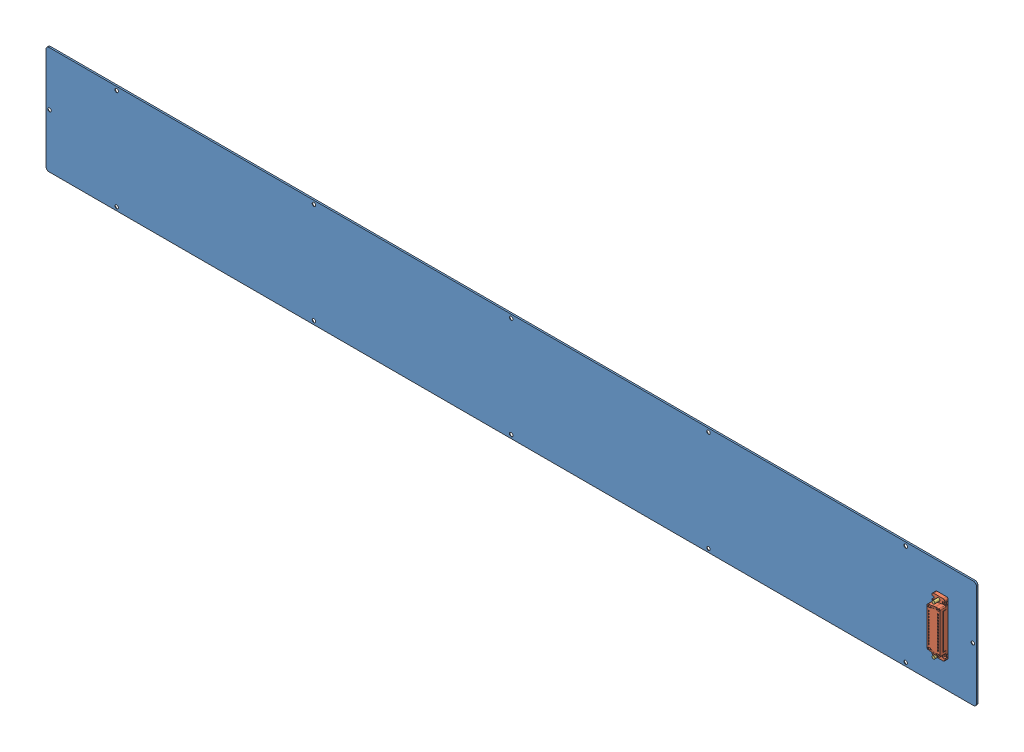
SolidWorks assembly Assy, Back Cover, X-Axis, 685mm Travel, ProdA, PP00.SLDASM, configuration Default (file format 8000). Lengths in mm.
Overall size (915 106 14.8).
4 component instances, 3 part files, 7 mates.
Components (placement in the parent):
- Cover, Back, X-Axis, 685mm Travel, ProdA, PP00-1: Cover, Back, X-Axis, 685mm Travel, ProdA, PP00.SLDPRT [Default] at origin size (915 106 1.57)
- Amp Dsub 25 Pin Recept IDC 1658610-2-1: Amp Dsub 25 Pin Recept IDC 1658610-2.SLDPRT [Default] at (423.5 -0.0204 -4.572) x (0 1 0) z (0 0 -1) size (53.09 12.6 14.38)
- Dsub_mtng_standoff-1: Dsub_mtng_standoff.sldprt [Default] at (423.5 -23.5 -5) x (1 0 0) z (0 -1 0) size (5.48 14.8 4.83)
- Dsub_mtng_standoff-2: Dsub_mtng_standoff.sldprt [Default] at (423.5 23.5 -5) x (1 0 0) z (0 -1 0) size (5.48 14.8 4.83)
Mates (geometry in assembly coordinates):
- Coincident304: coincident anti-aligned: plane of Cover, Back, X-Axis, 685mm Travel, ProdA, PP00-1 through (0 0 0) normal (0 0 -1); plane of Dsub_mtng_standoff-1 through (422.0569 -25.832 0) normal (0 0 1)
- Coincident305: coincident anti-aligned: plane of Cover, Back, X-Axis, 685mm Travel, ProdA, PP00-1 through (0 0 0) normal (0 0 -1); plane of Dsub_mtng_standoff-2 through (422.0569 21.168 0) normal (0 0 1)
- Concentric102: concentric anti-aligned: circle of Cover, Back, X-Axis, 685mm Travel, ProdA, PP00-1; cylinder of Amp Dsub 25 Pin Recept IDC 1658610-2-1 through (423.5 23.5 1.5748) axis (0 0 1) radius 1.524
- Parallel2: parallel anti-aligned: plane of Cover, Back, X-Axis, 685mm Travel, ProdA, PP00-1 through (-457.5 -53 1.5748) normal (-1 0 0); plane of Amp Dsub 25 Pin Recept IDC 1658610-2-1 through (429.7992 -24.9886 1.5748) normal (1 0 0)
- Coincident307: coincident anti-aligned: plane of Cover, Back, X-Axis, 685mm Travel, ProdA, PP00-1 through (0 0 1.5748) normal (0 0 1); plane of Amp Dsub 25 Pin Recept IDC 1658610-2-1 through (423.5 -0.0204 1.5748) normal (0 0 -1)
- Concentric104: concentric aligned: cylinder of Cover, Back, X-Axis, 685mm Travel, ProdA, PP00-1 through (423.5 -23.5 1.5748) axis (0 0 -1) radius 1.55; cylinder of Dsub_mtng_standoff-1 through (423.5 -23.5 9.8) axis (0 0 -1) radius 1.375
- Concentric105: concentric aligned: cylinder of Cover, Back, X-Axis, 685mm Travel, ProdA, PP00-1 through (423.5 23.5 1.5748) axis (0 0 -1) radius 1.55; cylinder of Dsub_mtng_standoff-2 through (423.5 23.5 9.8) axis (0 0 -1) radius 1.375
